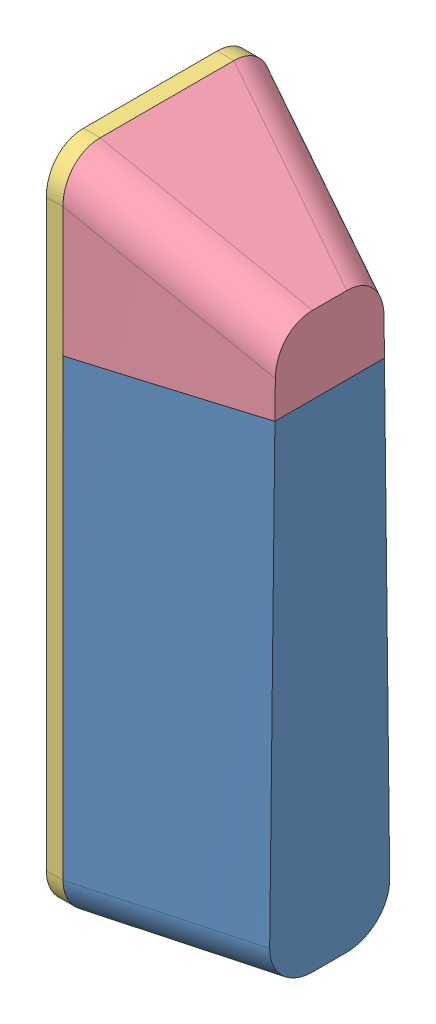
SolidWorks assembly Ensamblaje3.sldasm, configuration Predeterminado (file format 10000). Lengths in mm.
Overall size (43.08 161.36 51.3).
4 component instances, 4 part files, 3 mates.
Components (placement in the parent):
- cuerpo2-1: cuerpo2.sldprt [Predeterminado] at (-30.8811 -82.3147 119.6919) size (39.07 119.72 51.18)
- liquido2-1: liquido2.sldprt [Predeterminado] at (-30.8811 -82.3147 119.6919) size (31.09 70.02 39.28)
- parte frontal2-1: parte frontal2.sldprt [Predeterminado] at (-30.8811 -82.3147 119.6919) size (4.02 160.02 50.02)
- zona splash2-1: zona splash2.sldprt [Predeterminado] at (-30.8811 -82.3147 119.6919) size (39.07 41.64 51.25)
Mates (geometry in assembly coordinates):
- Coincidente1: coincident: point of cuerpo2-1; point of liquido2-1
- Coincidente2: coincident: point of cuerpo2-1; point of parte frontal2-1
- Coincidente3: coincident: point of cuerpo2-1; point of zona splash2-1
